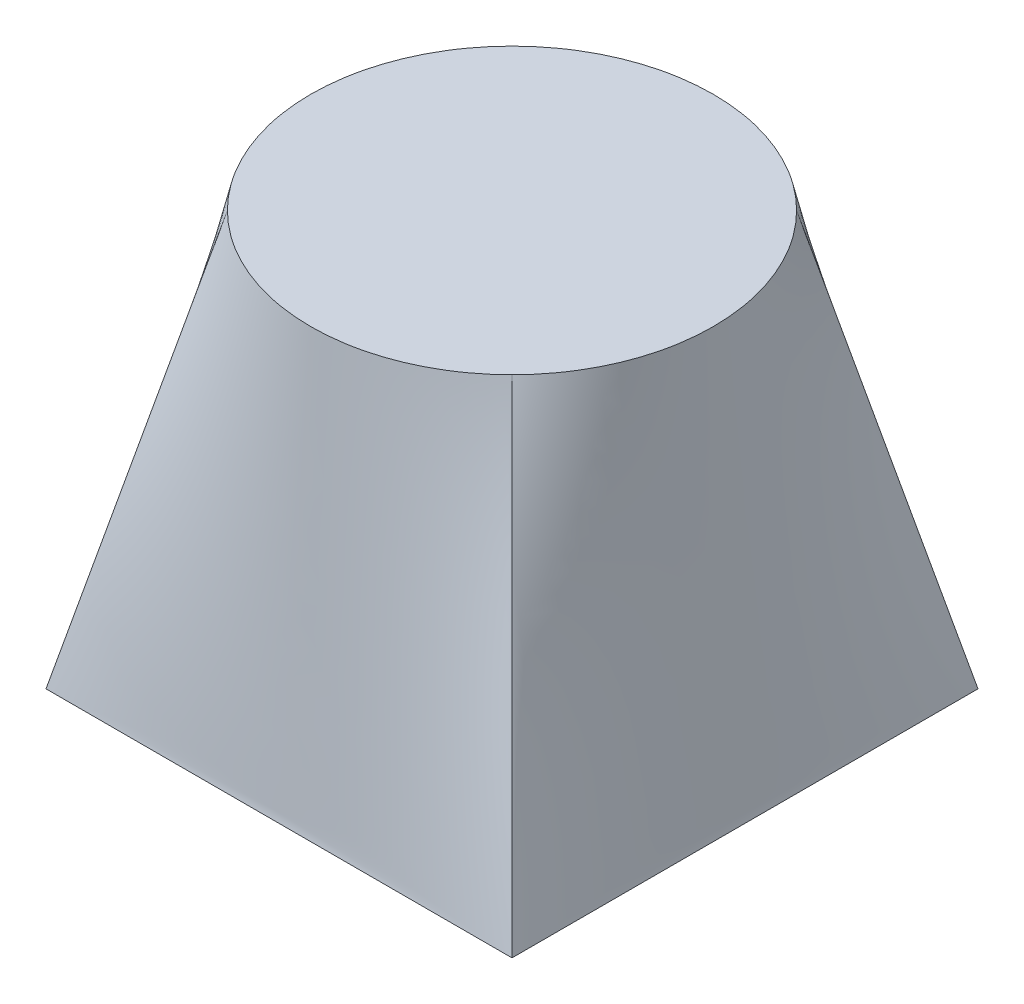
from build123d import *


with BuildPart() as part:
    # Sketch3 → Loft1 section 0
    with BuildSketch(Plane(origin=(0, 0, 0), x_dir=(1, 0, 0), z_dir=(0, 1, 0))):
        with BuildLine():
            Line((135.231835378, 101.740412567), (-21.376288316, 101.740412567))
            Line((-21.376288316, 101.740412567), (-21.376288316, -54.867711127))
            Line((-21.376288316, -54.867711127), (135.231835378, -54.867711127))
            Line((135.231835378, -54.867711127), (135.231835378, 101.740412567))
        make_face()
    # Sketch4 for Loft1 → Loft1 section 1
    with BuildSketch(Plane(origin=(0, 139.241837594, 0), x_dir=(-1, 0, 0), z_dir=(0, 1, 0))):
        with BuildLine():
            # circular arc as an exact rational Bezier (weights 1, cos(half-angle), 1)
            Bezier((-9.103711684, 24.387711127), (-56.927773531, 72.211772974), (-104.751835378, 24.387711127), weights=[1, 0.707106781, 1])
            Bezier((-104.751835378, 24.387711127), (-152.575897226, -23.43635072), (-104.751835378, -71.260412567), weights=[1, 0.707106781, 1])
            Bezier((-104.751835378, -71.260412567), (-56.927773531, -119.084474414), (-9.103711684, -71.260412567), weights=[1, 0.707106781, 1])
            Bezier((-9.103711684, -71.260412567), (38.720350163, -23.43635072), (-9.103711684, 24.387711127), weights=[1, 0.707106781, 1])
        make_face()
    loft()


solid = part.part
